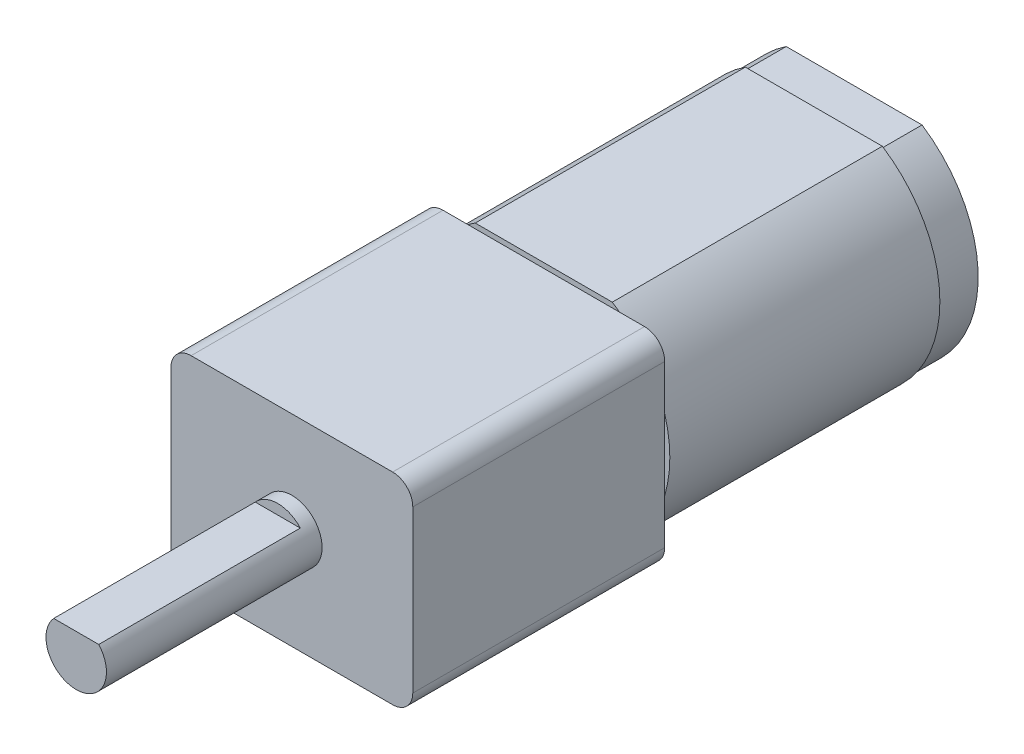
from build123d import *

# Parameters (mm, degrees)
EXTRUSION1_DEPTH = 12.5
ESQUISSE2_R      = 1.5
EXTRUSION2_DEPTH = 0.7
EXTRUSION3_DEPTH = 10
EXTRUSION4_DEPTH = 13.4
EXTRUSION5_DEPTH = 2


with BuildPart() as part:
    # Esquisse1 → Extrusion1 (new body)
    with BuildSketch(Plane.XY):
        with BuildLine():
            Line((-5, 5), (5, 5))
            ThreePointArc((5, 5), (5.707106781, 4.707106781), (6, 4))
            Line((6, 4), (6, -4))
            ThreePointArc((6, -4), (5.707106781, -4.707106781), (5, -5))
            Line((5, -5), (-5, -5))
            ThreePointArc((-5, -5), (-5.707106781, -4.707106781), (-6, -4))
            Line((-6, -4), (-6, 4))
            ThreePointArc((-6, 4), (-5.707106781, 4.707106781), (-5, 5))
        make_face()
    extrude(amount=-EXTRUSION1_DEPTH)

    # Esquisse2 → Extrusion2 (add)
    with BuildSketch(Plane.XY):
        Circle(ESQUISSE2_R)
    extrude(amount=EXTRUSION2_DEPTH)

    # Esquisse3 → Extrusion3 (add)
    with BuildSketch(Plane.XY.offset(0.7)):
        with BuildLine():
            Line((-1.118033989, 1), (1.118033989, 1))
            ThreePointArc((1.118033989, 1), (0, -1.5), (-1.118033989, 1))
        make_face()
    extrude(amount=EXTRUSION3_DEPTH)

    # Esquisse4 → Extrusion4 (add)
    with BuildSketch(Plane(origin=(0, 0, -12.5), x_dir=(-1, 0, 0), z_dir=(0, 0, -1))):
        with BuildLine():
            Line((-3.399146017, 5.25), (3.399146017, 5.25))
            ThreePointArc((3.399146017, 5.25), (6.254333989, 0), (3.399146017, -5.25))
            Line((3.399146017, -5.25), (-3.399146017, -5.25))
            ThreePointArc((-3.399146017, -5.25), (-6.254333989, 0), (-3.399146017, 5.25))
        make_face()
    extrude(amount=EXTRUSION4_DEPTH)

    # Esquisse5 → Extrusion5 (add)
    with BuildSketch(Plane(origin=(0, 0, -25.9), x_dir=(-1, 0, 0), z_dir=(0, 0, -1))):
        with BuildLine():
            Line((-3.369469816, -5.15), (3.369469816, -5.15))
            ThreePointArc((3.369469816, -5.15), (6.154333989, 0), (3.369469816, 5.15))
            Line((3.369469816, 5.15), (-3.369469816, 5.15))
            ThreePointArc((-3.369469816, 5.15), (-6.154333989, 0), (-3.369469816, -5.15))
        make_face()
    extrude(amount=EXTRUSION5_DEPTH)


solid = part.part
